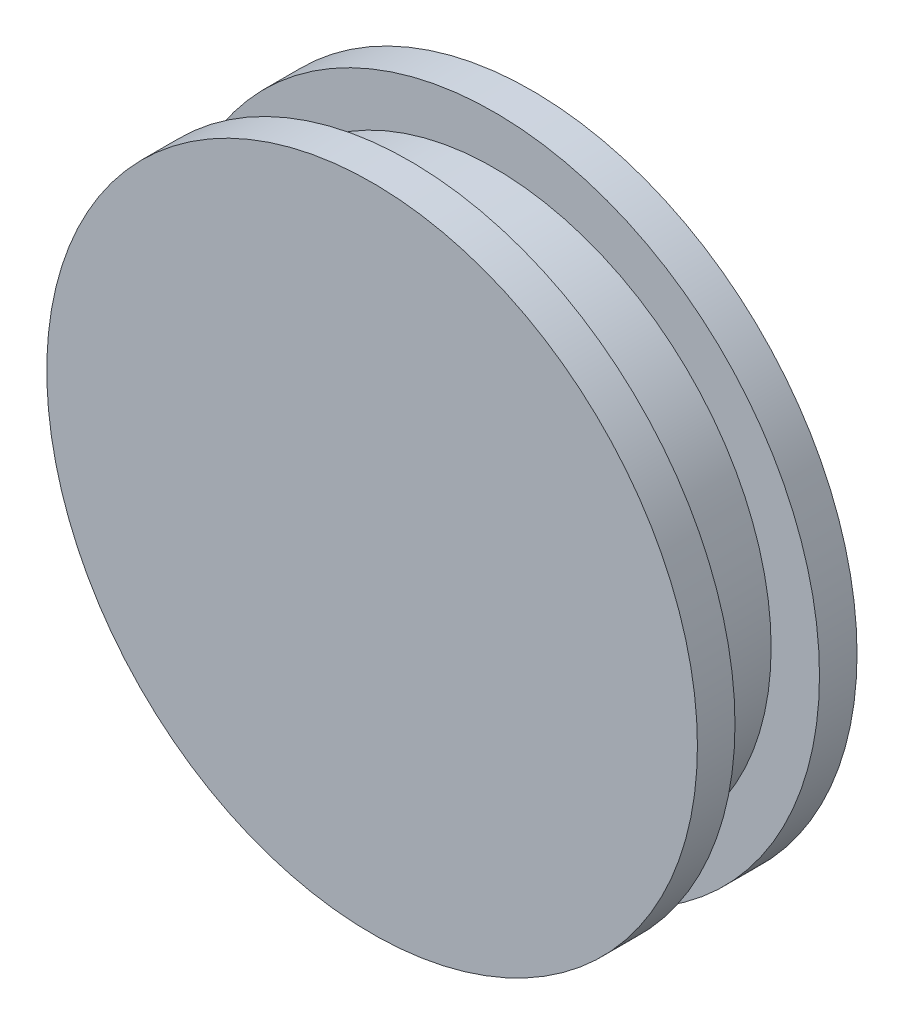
ISO-10303-21;
HEADER;
FILE_DESCRIPTION(('STEP AP214'),'2;1');
FILE_NAME('part.step','',(''),(''),'','','');
FILE_SCHEMA(('AUTOMOTIVE_DESIGN { 1 0 10303 214 1 1 1 1 }'));
ENDSEC;
DATA;
#1=APPLICATION_CONTEXT('core data for automotive mechanical design processes');
#2=APPLICATION_PROTOCOL_DEFINITION('international standard','automotive_design',2000,#1);
#3=PRODUCT_CONTEXT('',#1,'mechanical');
#4=PRODUCT('Part','Part','',(#3));
#5=PRODUCT_RELATED_PRODUCT_CATEGORY('part','',(#4));
#6=PRODUCT_DEFINITION_FORMATION('','',#4);
#7=PRODUCT_DEFINITION_CONTEXT('part definition',#1,'design');
#8=PRODUCT_DEFINITION('design','',#6,#7);
#9=PRODUCT_DEFINITION_SHAPE('','',#8);
#10=(LENGTH_UNIT() NAMED_UNIT(*) SI_UNIT(.MILLI.,.METRE.));
#11=(NAMED_UNIT(*) PLANE_ANGLE_UNIT() SI_UNIT($,.RADIAN.));
#12=(NAMED_UNIT(*) SI_UNIT($,.STERADIAN.) SOLID_ANGLE_UNIT());
#13=UNCERTAINTY_MEASURE_WITH_UNIT(LENGTH_MEASURE(1.E-05),#10,'distance_accuracy_value','');
#14=(GEOMETRIC_REPRESENTATION_CONTEXT(3) GLOBAL_UNCERTAINTY_ASSIGNED_CONTEXT((#13)) GLOBAL_UNIT_ASSIGNED_CONTEXT((#10,
#11,#12)) REPRESENTATION_CONTEXT('',''));
#15=CARTESIAN_POINT('',(0.,0.,0.));
#16=DIRECTION('',(0.,0.,1.));
#17=DIRECTION('',(1.,0.,0.));
#18=AXIS2_PLACEMENT_3D('',#15,#16,#17);
#19=CARTESIAN_POINT('',(8.80110000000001,-3.05311331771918E-13,-4.318));
#20=DIRECTION('',(0.,0.,-1.));
#21=DIRECTION('',(-1.,0.,0.));
#22=AXIS2_PLACEMENT_3D('',#19,#20,#21);
#23=PLANE('',#22);
#24=CARTESIAN_POINT('',(0.,0.,-4.318));
#25=DIRECTION('',(0.,0.,1.));
#26=DIRECTION('',(1.,0.,0.));
#27=AXIS2_PLACEMENT_3D('',#24,#25,#26);
#28=CIRCLE('',#27,8.8011);
#29=CARTESIAN_POINT('',(8.8011,0.,-4.318));
#30=VERTEX_POINT('',#29);
#31=EDGE_CURVE('E10',#30,#30,#28,.T.);
#32=ORIENTED_EDGE('',*,*,#31,.F.);
#33=EDGE_LOOP('',(#32));
#34=FACE_BOUND('',#33,.T.);
#35=ADVANCED_FACE('F30',(#34),#23,.T.);
#36=CARTESIAN_POINT('',(0.,0.,0.));
#37=DIRECTION('',(0.,0.,1.));
#38=DIRECTION('',(1.,0.,0.));
#39=AXIS2_PLACEMENT_3D('',#36,#37,#38);
#40=CYLINDRICAL_SURFACE('',#39,8.8011);
#41=ORIENTED_EDGE('',*,*,#31,.T.);
#42=EDGE_LOOP('',(#41));
#43=FACE_BOUND('',#42,.T.);
#44=CARTESIAN_POINT('',(0.,0.,-3.302));
#45=DIRECTION('',(0.,0.,1.));
#46=DIRECTION('',(1.,0.,0.));
#47=AXIS2_PLACEMENT_3D('',#44,#45,#46);
#48=CIRCLE('',#47,8.8011);
#49=CARTESIAN_POINT('',(8.8011,0.,-3.302));
#50=VERTEX_POINT('',#49);
#51=EDGE_CURVE('E36',#50,#50,#48,.T.);
#52=ORIENTED_EDGE('',*,*,#51,.F.);
#53=EDGE_LOOP('',(#52));
#54=FACE_BOUND('',#53,.T.);
#55=ADVANCED_FACE('F72',(#43,#54),#40,.T.);
#56=CARTESIAN_POINT('',(8.80110000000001,-3.05311331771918E-13,-3.302));
#57=DIRECTION('',(0.,0.,1.));
#58=DIRECTION('',(1.,0.,0.));
#59=AXIS2_PLACEMENT_3D('',#56,#57,#58);
#60=PLANE('',#59);
#61=ORIENTED_EDGE('',*,*,#51,.T.);
#62=EDGE_LOOP('',(#61));
#63=FACE_BOUND('',#62,.T.);
#64=CARTESIAN_POINT('',(0.,0.,-3.302));
#65=DIRECTION('',(0.,0.,1.));
#66=DIRECTION('',(1.,0.,0.));
#67=AXIS2_PLACEMENT_3D('',#64,#65,#66);
#68=CIRCLE('',#67,7.493);
#69=CARTESIAN_POINT('',(7.493,0.,-3.302));
#70=VERTEX_POINT('',#69);
#71=EDGE_CURVE('E40',#70,#70,#68,.T.);
#72=ORIENTED_EDGE('',*,*,#71,.F.);
#73=EDGE_LOOP('',(#72));
#74=FACE_BOUND('',#73,.T.);
#75=ADVANCED_FACE('F77',(#63,#74),#60,.T.);
#76=CARTESIAN_POINT('',(0.,0.,0.));
#77=DIRECTION('',(0.,0.,1.));
#78=DIRECTION('',(1.,0.,0.));
#79=AXIS2_PLACEMENT_3D('',#76,#77,#78);
#80=CYLINDRICAL_SURFACE('',#79,7.493);
#81=ORIENTED_EDGE('',*,*,#71,.T.);
#82=EDGE_LOOP('',(#81));
#83=FACE_BOUND('',#82,.T.);
#84=CARTESIAN_POINT('',(0.,0.,-1.016));
#85=DIRECTION('',(0.,0.,1.));
#86=DIRECTION('',(1.,0.,0.));
#87=AXIS2_PLACEMENT_3D('',#84,#85,#86);
#88=CIRCLE('',#87,7.493);
#89=CARTESIAN_POINT('',(7.493,0.,-1.016));
#90=VERTEX_POINT('',#89);
#91=EDGE_CURVE('E44',#90,#90,#88,.T.);
#92=ORIENTED_EDGE('',*,*,#91,.F.);
#93=EDGE_LOOP('',(#92));
#94=FACE_BOUND('',#93,.T.);
#95=ADVANCED_FACE('F68',(#83,#94),#80,.T.);
#96=CARTESIAN_POINT('',(8.80110000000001,-3.05311331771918E-13,-1.016));
#97=DIRECTION('',(0.,0.,-1.));
#98=DIRECTION('',(-1.,0.,0.));
#99=AXIS2_PLACEMENT_3D('',#96,#97,#98);
#100=PLANE('',#99);
#101=ORIENTED_EDGE('',*,*,#91,.T.);
#102=EDGE_LOOP('',(#101));
#103=FACE_BOUND('',#102,.T.);
#104=CARTESIAN_POINT('',(0.,0.,-1.016));
#105=DIRECTION('',(0.,0.,1.));
#106=DIRECTION('',(1.,0.,0.));
#107=AXIS2_PLACEMENT_3D('',#104,#105,#106);
#108=CIRCLE('',#107,8.8011);
#109=CARTESIAN_POINT('',(8.8011,0.,-1.016));
#110=VERTEX_POINT('',#109);
#111=EDGE_CURVE('E49',#110,#110,#108,.T.);
#112=ORIENTED_EDGE('',*,*,#111,.F.);
#113=EDGE_LOOP('',(#112));
#114=FACE_BOUND('',#113,.T.);
#115=ADVANCED_FACE('F60',(#103,#114),#100,.T.);
#116=CARTESIAN_POINT('',(0.,0.,0.));
#117=DIRECTION('',(0.,0.,1.));
#118=DIRECTION('',(1.,0.,0.));
#119=AXIS2_PLACEMENT_3D('',#116,#117,#118);
#120=CYLINDRICAL_SURFACE('',#119,8.8011);
#121=ORIENTED_EDGE('',*,*,#111,.T.);
#122=EDGE_LOOP('',(#121));
#123=FACE_BOUND('',#122,.T.);
#124=CARTESIAN_POINT('',(0.,0.,0.));
#125=DIRECTION('',(0.,0.,1.));
#126=DIRECTION('',(1.,0.,0.));
#127=AXIS2_PLACEMENT_3D('',#124,#125,#126);
#128=CIRCLE('',#127,8.8011);
#129=CARTESIAN_POINT('',(8.8011,0.,0.));
#130=VERTEX_POINT('',#129);
#131=EDGE_CURVE('E52',#130,#130,#128,.T.);
#132=ORIENTED_EDGE('',*,*,#131,.F.);
#133=EDGE_LOOP('',(#132));
#134=FACE_BOUND('',#133,.T.);
#135=ADVANCED_FACE('F58',(#123,#134),#120,.T.);
#136=CARTESIAN_POINT('',(0.,0.,0.));
#137=DIRECTION('',(0.,0.,1.));
#138=DIRECTION('',(1.,0.,0.));
#139=AXIS2_PLACEMENT_3D('',#136,#137,#138);
#140=PLANE('',#139);
#141=ORIENTED_EDGE('',*,*,#131,.T.);
#142=EDGE_LOOP('',(#141));
#143=FACE_BOUND('',#142,.T.);
#144=ADVANCED_FACE('F56',(#143),#140,.T.);
#145=CLOSED_SHELL('',(#35,#55,#75,#95,#115,#135,#144));
#146=MANIFOLD_SOLID_BREP('B2',#145);
#147=ADVANCED_BREP_SHAPE_REPRESENTATION('',(#18,#146),#14);
#148=SHAPE_DEFINITION_REPRESENTATION(#9,#147);
ENDSEC;
END-ISO-10303-21;
